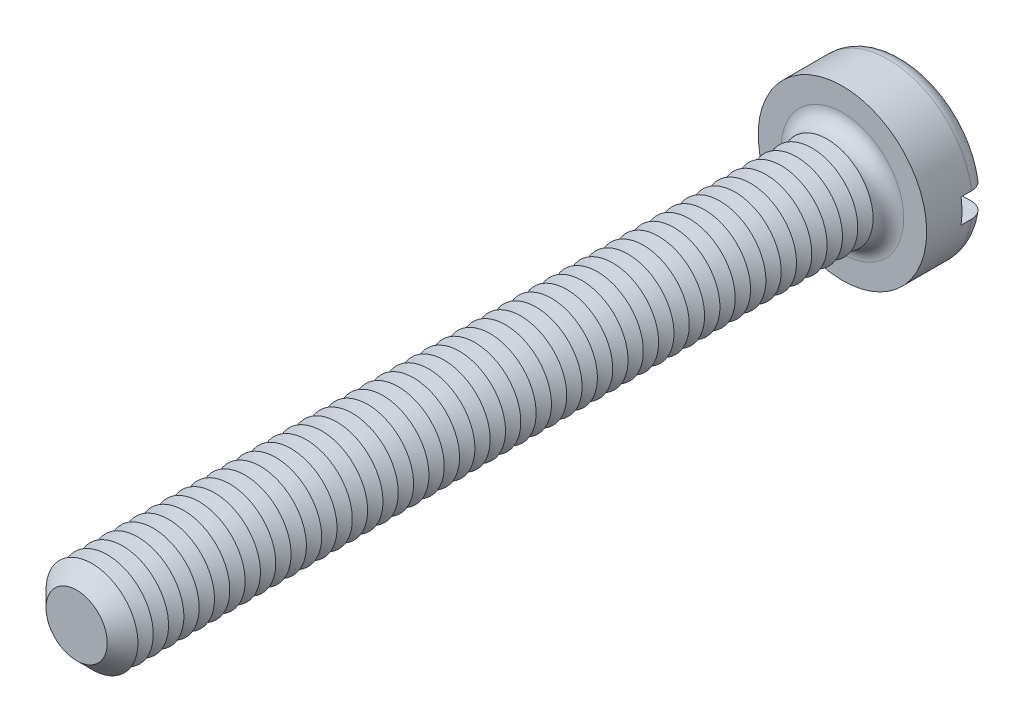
from build123d import *

# Parameters (mm, degrees)
SKETCH3_R           = 2.75
BOSS_EXTRUDE2_DEPTH = 2
SKETCH4_R           = 1.5
BOSS_EXTRUDE3_DEPTH = 25
FILLET1_R           = 0.5
CHAMFER1_SIZE       = 0.5
LPATTERN1_COUNT     = 48
LPATTERN1_PITCH     = 0.5
SKETCH8_W           = 5.5
SKETCH8_H           = 0.8
CUT_EXTRUDE1_DEPTH  = 0.85


with BuildPart() as part:
    # Sketch3 → Boss-Extrude2 (new body)
    with BuildSketch(Plane.XY):
        Circle(SKETCH3_R)
    extrude(amount=-BOSS_EXTRUDE2_DEPTH)

    # Sketch4 → Boss-Extrude3 (add)
    with BuildSketch(Plane.XY):
        Circle(SKETCH4_R)
    extrude(amount=BOSS_EXTRUDE3_DEPTH)

    # Fillet1
    fillet1_edges = [part.edges().sort_by_distance(p)[0] for p in [
        (-2.75, 0, -2),
        (-1.5, 0, 0),
    ]]
    fillet(fillet1_edges, radius=FILLET1_R)

    # Chamfer1
    chamfer1_edges = [part.edges().sort_by_distance(p)[0] for p in [
        (-1.5, 0, 25),
    ]]
    chamfer(chamfer1_edges, length=CHAMFER1_SIZE)

    # Sketch6 → Cut-Revolve1 (revolve, cut)
    with BuildSketch(Plane(origin=(0, 0, 0), x_dir=(0, 0, -1), z_dir=(1, 0, 0)), mode=Mode.PRIVATE) as cut_revolve1_sk:
        Polygon((-0.5, 1.5), (-0.75, 1.066987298), (-1, 1.5), align=None)
    cut_revolve1 = revolve(cut_revolve1_sk.sketch.rotate(Axis((0, 0, -1.694361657), (0, 0, 1)), 90), axis=Axis((0, 0, -1.694361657), (0, 0, 1)), mode=Mode.SUBTRACT)

    # LPattern1: Cut-Revolve1 ×48
    with Locations(*[(0, 0, i * LPATTERN1_PITCH) for i in range(1, LPATTERN1_COUNT)]):
        add(cut_revolve1, mode=Mode.SUBTRACT)

    # Sketch8 → Cut-Extrude1 (cut)
    with BuildSketch(Plane(origin=(0, 0, -2), x_dir=(-1, 0, 0), z_dir=(0, 0, -1))):
        Rectangle(SKETCH8_W, SKETCH8_H)
    extrude(amount=-CUT_EXTRUDE1_DEPTH, mode=Mode.SUBTRACT)


solid = part.part
